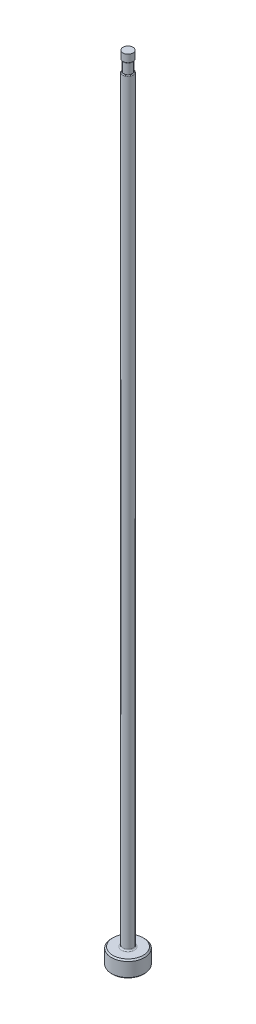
from build123d import *

# Parameters (mm, degrees)
CHAMFER1_SIZE     = 0.254
FILLET1_R         = 0.254
SKETCH2_W         = 0.2032
SKETCH2_H         = 2.032
D_SLOT_DEPTH      = 153.466131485
D_SLOT_DEPTH_BACK = 153.466131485
SKETCH5_W         = 0.0254
SKETCH5_H         = 1.524
FILLET2_R         = 0.127


with BuildPart() as part:
    # Sketch1 → Revolve1 (revolve)
    with BuildSketch(Plane.XY, mode=Mode.PRIVATE) as revolve1_sk:
        Polygon((0, 0), (-3.175, 0), (-3.175, 3.175), (-0.99187, 3.175), (-0.99187, 152.4), (0, 152.4), align=None)
    revolve(revolve1_sk.sketch.rotate(Axis((0, 259.958771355, 0), (0, -1, 0)), 270), axis=Axis((0, 259.958771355, 0), (0, -1, 0)))

    # Chamfer1
    chamfer1_edges = [part.edges().sort_by_distance(p)[0] for p in [
        (0, 3.175, -3.175),
        (0, 0, -3.175),
    ]]
    chamfer(chamfer1_edges, length=CHAMFER1_SIZE)

    # Fillet1
    fillet1_edges = [part.edges().sort_by_distance(p)[0] for p in [
        (0, 3.175, -0.99187),
    ]]
    fillet(fillet1_edges, radius=FILLET1_R)

    # Sketch2 → Vent Relief (revolve, cut)
    with BuildSketch(Plane.XY, mode=Mode.PRIVATE) as vent_relief_sk:
        with Locations((-0.89027, 149.86)):
            Rectangle(SKETCH2_W, SKETCH2_H)
    revolve(vent_relief_sk.sketch.rotate(Axis((0, 153.448281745, 0), (0, -1, 0)), 270), axis=Axis((0, 153.448281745, 0), (0, -1, 0)), mode=Mode.SUBTRACT)

    # Sketch3 → D-Slot (cut, two sides: drawn at the far end of the back side and taken through both)
    with BuildSketch(Plane.XY.offset(-D_SLOT_DEPTH_BACK)):
        with BuildLine():
            Line((-0.78867, 149.86), (-0.78867, 86.36))
            ThreePointArc((-0.78867, 86.36), (-0.839883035, 85.792038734), (-0.99187, 85.2424))
            Line((-0.99187, 85.2424), (-0.99187, 149.86))
            Line((-0.99187, 149.86), (-0.78867, 149.86))
        make_face()
    extrude(amount=D_SLOT_DEPTH + D_SLOT_DEPTH_BACK, mode=Mode.SUBTRACT)

    # Sketch5 → Vent Diameter (revolve, cut)
    with BuildSketch(Plane.XY, mode=Mode.PRIVATE) as vent_diameter_sk:
        with Locations((-0.97917, 151.638)):
            Rectangle(SKETCH5_W, SKETCH5_H)
    revolve(vent_diameter_sk.sketch.rotate(Axis((0, 152.687735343, 0), (0, -1, 0)), 90), axis=Axis((0, 152.687735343, 0), (0, -1, 0)), mode=Mode.SUBTRACT)

    # Fillet2
    fillet2_edges = [part.edges().sort_by_distance(p)[0] for p in [
        (0.888937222, 148.844, -0.439996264),
        (0, 150.876, 0.96647),
    ]]
    fillet(fillet2_edges, radius=FILLET2_R)


solid = part.part
